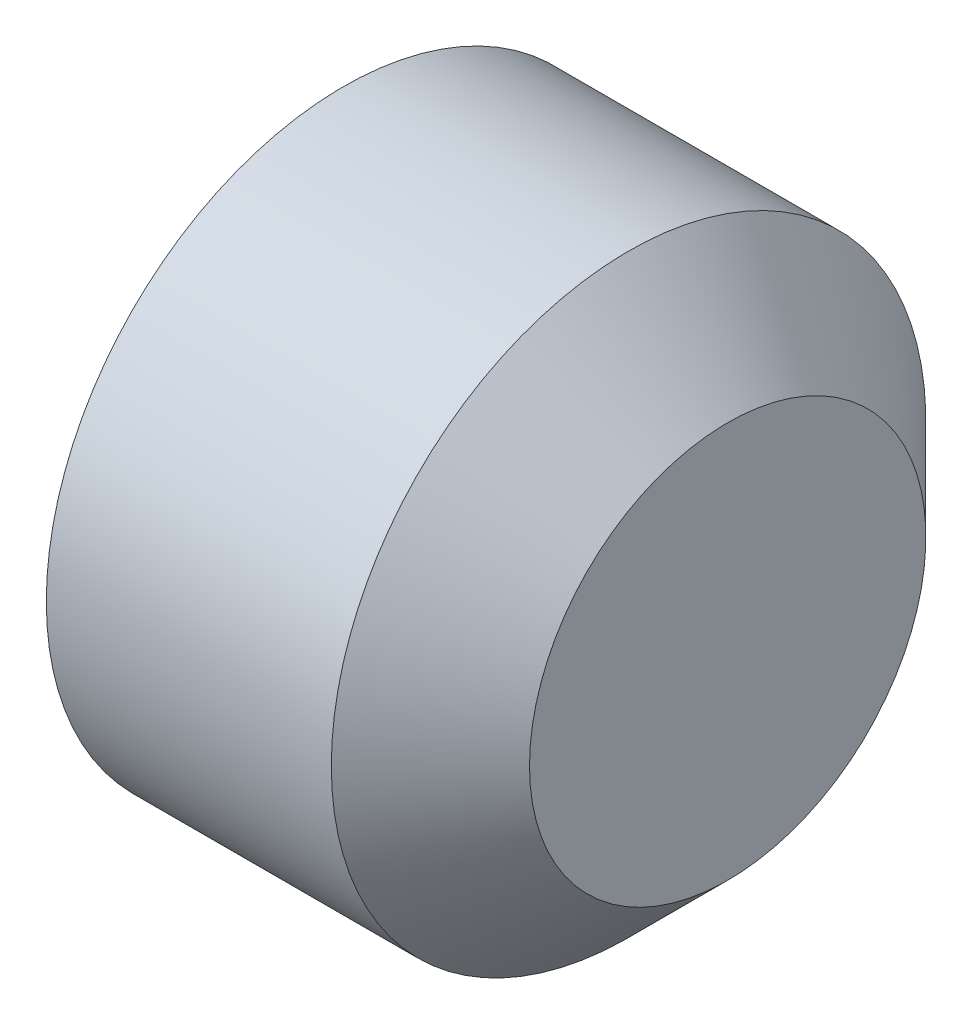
from build123d import *

# Parameters (mm, degrees)
HEX_2_DEPTH = 1.2


with BuildPart() as part:
    # BodySke → BaseBody (revolve)
    with BuildSketch(Plane.XY, mode=Mode.PRIVATE) as basebody_sk:
        Polygon((0, 0), (0, 1.2195), (0.161946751, 1.5), (1.6, 1.5), (2.1, 1), (2.1, 0), align=None)
    revolve(basebody_sk.sketch.rotate(Axis((-12.7, 0, 0), (1, 0, 0)), 90), axis=Axis((-12.7, 0, 0), (1, 0, 0)))

    # Sketch2 → Hex 2 (cut)
    with BuildSketch(Plane.ZY):
        Polygon((0.433012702, 0.75), (-0.433012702, 0.75), (-0.866025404, 0), (-0.433012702, -0.75), (0.433012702, -0.75), (0.866025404, 0), align=None)
    extrude(amount=-HEX_2_DEPTH, mode=Mode.SUBTRACT)


solid = part.part
